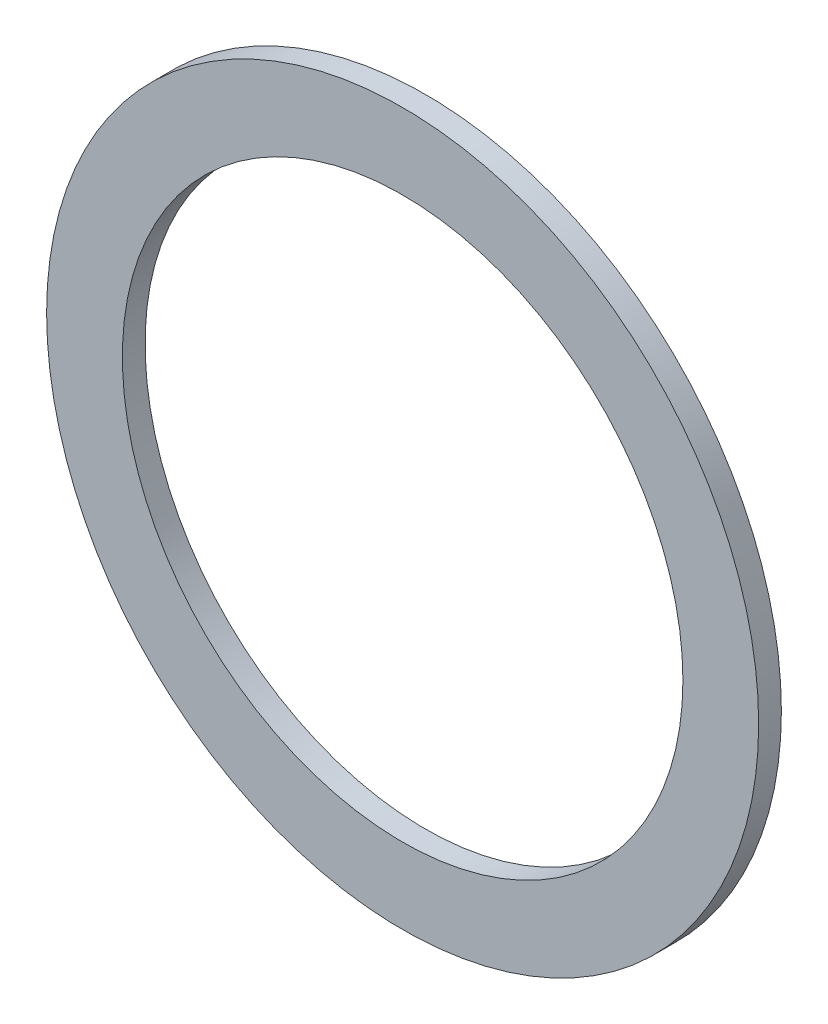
from build123d import *

# Parameters (mm, degrees)
ESQUISSE1_R          = 23.5
ESQUISSE1_R_2        = 18.5
BASE_EXTRUSION_DEPTH = 1.5


with BuildPart() as part:
    # Esquisse1 → Base-Extrusion (new body)
    with BuildSketch(Plane.XY):
        Circle(ESQUISSE1_R)
        Circle(ESQUISSE1_R_2, mode=Mode.SUBTRACT)
    extrude(amount=BASE_EXTRUSION_DEPTH)


solid = part.part
